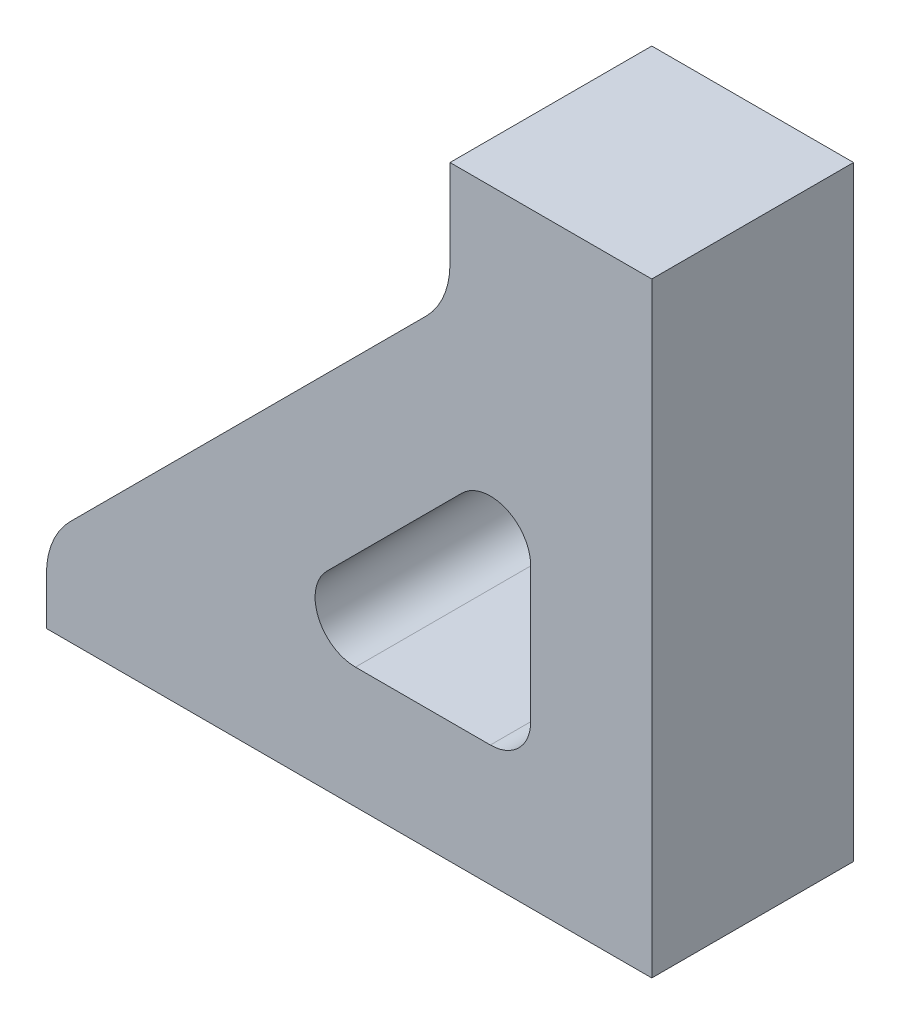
ISO-10303-21;
HEADER;
FILE_DESCRIPTION(('STEP AP214'),'2;1');
FILE_NAME('part.step','',(''),(''),'','','');
FILE_SCHEMA(('AUTOMOTIVE_DESIGN { 1 0 10303 214 1 1 1 1 }'));
ENDSEC;
DATA;
#1=APPLICATION_CONTEXT('core data for automotive mechanical design processes');
#2=APPLICATION_PROTOCOL_DEFINITION('international standard','automotive_design',2000,#1);
#3=PRODUCT_CONTEXT('',#1,'mechanical');
#4=PRODUCT('Part','Part','',(#3));
#5=PRODUCT_RELATED_PRODUCT_CATEGORY('part','',(#4));
#6=PRODUCT_DEFINITION_FORMATION('','',#4);
#7=PRODUCT_DEFINITION_CONTEXT('part definition',#1,'design');
#8=PRODUCT_DEFINITION('design','',#6,#7);
#9=PRODUCT_DEFINITION_SHAPE('','',#8);
#10=(LENGTH_UNIT() NAMED_UNIT(*) SI_UNIT(.MILLI.,.METRE.));
#11=(NAMED_UNIT(*) PLANE_ANGLE_UNIT() SI_UNIT($,.RADIAN.));
#12=(NAMED_UNIT(*) SI_UNIT($,.STERADIAN.) SOLID_ANGLE_UNIT());
#13=UNCERTAINTY_MEASURE_WITH_UNIT(LENGTH_MEASURE(1.E-05),#10,'distance_accuracy_value','');
#14=(GEOMETRIC_REPRESENTATION_CONTEXT(3) GLOBAL_UNCERTAINTY_ASSIGNED_CONTEXT((#13)) GLOBAL_UNIT_ASSIGNED_CONTEXT((#10,
#11,#12)) REPRESENTATION_CONTEXT('',''));
#15=CARTESIAN_POINT('',(0.,0.,0.));
#16=DIRECTION('',(0.,0.,1.));
#17=DIRECTION('',(1.,0.,0.));
#18=AXIS2_PLACEMENT_3D('',#15,#16,#17);
#19=CARTESIAN_POINT('',(0.,0.,-5.));
#20=DIRECTION('',(0.,0.,1.));
#21=DIRECTION('',(1.,0.,0.));
#22=AXIS2_PLACEMENT_3D('',#19,#20,#21);
#23=PLANE('',#22);
#24=DIRECTION('',(1.,0.,0.));
#25=VECTOR('',#24,1.);
#26=CARTESIAN_POINT('',(9.,6.,-5.));
#27=LINE('',#26,#25);
#28=CARTESIAN_POINT('',(7.,6.,-5.));
#29=VERTEX_POINT('',#28);
#30=CARTESIAN_POINT('',(0.3137084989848,6.,-5.));
#31=VERTEX_POINT('',#30);
#32=EDGE_CURVE('E163',#29,#31,#27,.F.);
#33=ORIENTED_EDGE('',*,*,#32,.F.);
#34=CARTESIAN_POINT('',(7.,8.,-5.));
#35=DIRECTION('',(0.,0.,1.));
#36=DIRECTION('',(1.,0.,0.));
#37=AXIS2_PLACEMENT_3D('',#34,#35,#36);
#38=CIRCLE('',#37,2.);
#39=CARTESIAN_POINT('',(9.,8.,-5.));
#40=VERTEX_POINT('',#39);
#41=EDGE_CURVE('E167',#29,#40,#38,.T.);
#42=ORIENTED_EDGE('',*,*,#41,.T.);
#43=DIRECTION('',(0.,1.,0.));
#44=VECTOR('',#43,1.);
#45=CARTESIAN_POINT('',(9.,19.51471862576,-5.));
#46=LINE('',#45,#44);
#47=CARTESIAN_POINT('',(9.,14.68629150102,-5.));
#48=VERTEX_POINT('',#47);
#49=EDGE_CURVE('E154',#48,#40,#46,.F.);
#50=ORIENTED_EDGE('',*,*,#49,.F.);
#51=CARTESIAN_POINT('',(7.,14.68629150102,-5.));
#52=DIRECTION('',(0.,0.,1.));
#53=DIRECTION('',(1.,0.,0.));
#54=AXIS2_PLACEMENT_3D('',#51,#52,#53);
#55=CIRCLE('',#54,2.);
#56=CARTESIAN_POINT('',(5.58578643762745,16.100505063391,-5.));
#57=VERTEX_POINT('',#56);
#58=EDGE_CURVE('E161',#48,#57,#55,.T.);
#59=ORIENTED_EDGE('',*,*,#58,.T.);
#60=DIRECTION('',(0.707106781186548,0.707106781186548,0.));
#61=VECTOR('',#60,1.);
#62=CARTESIAN_POINT('',(-4.514718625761,6.,-5.));
#63=LINE('',#62,#61);
#64=CARTESIAN_POINT('',(-1.10050506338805,9.41421356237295,-5.));
#65=VERTEX_POINT('',#64);
#66=EDGE_CURVE('E158',#65,#57,#63,.T.);
#67=ORIENTED_EDGE('',*,*,#66,.F.);
#68=CARTESIAN_POINT('',(0.3137084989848,8.,-5.));
#69=DIRECTION('',(0.,0.,1.));
#70=DIRECTION('',(1.,0.,0.));
#71=AXIS2_PLACEMENT_3D('',#68,#69,#70);
#72=CIRCLE('',#71,2.);
#73=EDGE_CURVE('E207',#65,#31,#72,.T.);
#74=ORIENTED_EDGE('',*,*,#73,.T.);
#75=EDGE_LOOP('',(#33,#42,#50,#59,#67,#74));
#76=FACE_BOUND('',#75,.T.);
#77=CARTESIAN_POINT('',(1.,25.65685424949,-5.));
#78=DIRECTION('',(0.,0.,1.));
#79=DIRECTION('',(1.,0.,0.));
#80=AXIS2_PLACEMENT_3D('',#77,#78,#79);
#81=CIRCLE('',#80,4.);
#82=CARTESIAN_POINT('',(3.8284271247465,22.8284271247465,-5.));
#83=VERTEX_POINT('',#82);
#84=CARTESIAN_POINT('',(5.,25.65685424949,-5.));
#85=VERTEX_POINT('',#84);
#86=EDGE_CURVE('E20',#83,#85,#81,.T.);
#87=ORIENTED_EDGE('',*,*,#86,.T.);
#88=DIRECTION('',(0.,1.,0.));
#89=VECTOR('',#88,1.);
#90=CARTESIAN_POINT('',(5.,30.,-5.));
#91=LINE('',#90,#89);
#92=CARTESIAN_POINT('',(5.,30.,-5.));
#93=VERTEX_POINT('',#92);
#94=EDGE_CURVE('E173',#93,#85,#91,.F.);
#95=ORIENTED_EDGE('',*,*,#94,.F.);
#96=DIRECTION('',(1.,0.,0.));
#97=VECTOR('',#96,1.);
#98=CARTESIAN_POINT('',(15.,30.,-5.));
#99=LINE('',#98,#97);
#100=CARTESIAN_POINT('',(15.,30.,-5.));
#101=VERTEX_POINT('',#100);
#102=EDGE_CURVE('E106',#101,#93,#99,.F.);
#103=ORIENTED_EDGE('',*,*,#102,.F.);
#104=DIRECTION('',(0.,1.,0.));
#105=VECTOR('',#104,1.);
#106=CARTESIAN_POINT('',(15.,0.,-5.));
#107=LINE('',#106,#105);
#108=CARTESIAN_POINT('',(15.,0.,-5.));
#109=VERTEX_POINT('',#108);
#110=EDGE_CURVE('E138',#109,#101,#107,.T.);
#111=ORIENTED_EDGE('',*,*,#110,.F.);
#112=DIRECTION('',(1.,0.,0.));
#113=VECTOR('',#112,1.);
#114=CARTESIAN_POINT('',(-15.,0.,-5.));
#115=LINE('',#114,#113);
#116=CARTESIAN_POINT('',(-15.,0.,-5.));
#117=VERTEX_POINT('',#116);
#118=EDGE_CURVE('E137',#117,#109,#115,.T.);
#119=ORIENTED_EDGE('',*,*,#118,.F.);
#120=DIRECTION('',(0.,1.,0.));
#121=VECTOR('',#120,1.);
#122=CARTESIAN_POINT('',(-15.,4.,-5.));
#123=LINE('',#122,#121);
#124=CARTESIAN_POINT('',(-15.,2.343145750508,-5.));
#125=VERTEX_POINT('',#124);
#126=EDGE_CURVE('E125',#125,#117,#123,.F.);
#127=ORIENTED_EDGE('',*,*,#126,.F.);
#128=CARTESIAN_POINT('',(-11.,2.343145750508,-5.));
#129=DIRECTION('',(0.,0.,-1.));
#130=DIRECTION('',(-1.,0.,0.));
#131=AXIS2_PLACEMENT_3D('',#128,#129,#130);
#132=CIRCLE('',#131,4.);
#133=CARTESIAN_POINT('',(-13.8284271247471,5.1715728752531,-5.));
#134=VERTEX_POINT('',#133);
#135=EDGE_CURVE('E210',#134,#125,#132,.F.);
#136=ORIENTED_EDGE('',*,*,#135,.F.);
#137=DIRECTION('',(-0.707106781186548,-0.707106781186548,0.));
#138=VECTOR('',#137,1.);
#139=CARTESIAN_POINT('',(5.,24.,-5.));
#140=LINE('',#139,#138);
#141=EDGE_CURVE('E168',#83,#134,#140,.T.);
#142=ORIENTED_EDGE('',*,*,#141,.F.);
#143=EDGE_LOOP('',(#87,#95,#103,#111,#119,#127,#136,#142));
#144=FACE_BOUND('',#143,.T.);
#145=ADVANCED_FACE('F16',(#76,#144),#23,.F.);
#146=CARTESIAN_POINT('',(-15.,4.,-5.));
#147=DIRECTION('',(-1.,0.,0.));
#148=DIRECTION('',(0.,0.,1.));
#149=AXIS2_PLACEMENT_3D('',#146,#147,#148);
#150=PLANE('',#149);
#151=DIRECTION('',(0.,1.,0.));
#152=VECTOR('',#151,1.);
#153=CARTESIAN_POINT('',(-15.,0.,5.));
#154=LINE('',#153,#152);
#155=CARTESIAN_POINT('',(-15.,2.343145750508,5.));
#156=VERTEX_POINT('',#155);
#157=CARTESIAN_POINT('',(-15.,0.,5.));
#158=VERTEX_POINT('',#157);
#159=EDGE_CURVE('E242',#156,#158,#154,.F.);
#160=ORIENTED_EDGE('',*,*,#159,.F.);
#161=DIRECTION('',(0.,0.,-1.));
#162=VECTOR('',#161,1.);
#163=CARTESIAN_POINT('',(-15.,2.343145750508,18.036));
#164=LINE('',#163,#162);
#165=EDGE_CURVE('E132',#125,#156,#164,.F.);
#166=ORIENTED_EDGE('',*,*,#165,.F.);
#167=ORIENTED_EDGE('',*,*,#126,.T.);
#168=DIRECTION('',(0.,0.,-1.));
#169=VECTOR('',#168,1.);
#170=CARTESIAN_POINT('',(-15.,0.,-5.));
#171=LINE('',#170,#169);
#172=EDGE_CURVE('E129',#158,#117,#171,.T.);
#173=ORIENTED_EDGE('',*,*,#172,.F.);
#174=EDGE_LOOP('',(#160,#166,#167,#173));
#175=FACE_BOUND('',#174,.T.);
#176=ADVANCED_FACE('F127',(#175),#150,.T.);
#177=CARTESIAN_POINT('',(-15.,0.,-5.));
#178=DIRECTION('',(0.,-1.,0.));
#179=DIRECTION('',(0.,0.,-1.));
#180=AXIS2_PLACEMENT_3D('',#177,#178,#179);
#181=PLANE('',#180);
#182=ORIENTED_EDGE('',*,*,#172,.T.);
#183=ORIENTED_EDGE('',*,*,#118,.T.);
#184=DIRECTION('',(0.,0.,-1.));
#185=VECTOR('',#184,1.);
#186=CARTESIAN_POINT('',(15.,0.,-5.));
#187=LINE('',#186,#185);
#188=CARTESIAN_POINT('',(15.,0.,5.));
#189=VERTEX_POINT('',#188);
#190=EDGE_CURVE('E141',#189,#109,#187,.T.);
#191=ORIENTED_EDGE('',*,*,#190,.F.);
#192=DIRECTION('',(1.,0.,0.));
#193=VECTOR('',#192,1.);
#194=CARTESIAN_POINT('',(0.,0.,5.));
#195=LINE('',#194,#193);
#196=EDGE_CURVE('E145',#158,#189,#195,.T.);
#197=ORIENTED_EDGE('',*,*,#196,.F.);
#198=EDGE_LOOP('',(#182,#183,#191,#197));
#199=FACE_BOUND('',#198,.T.);
#200=ADVANCED_FACE('F143',(#199),#181,.T.);
#201=CARTESIAN_POINT('',(15.,0.,-5.));
#202=DIRECTION('',(1.,0.,0.));
#203=DIRECTION('',(0.,0.,-1.));
#204=AXIS2_PLACEMENT_3D('',#201,#202,#203);
#205=PLANE('',#204);
#206=ORIENTED_EDGE('',*,*,#190,.T.);
#207=ORIENTED_EDGE('',*,*,#110,.T.);
#208=DIRECTION('',(0.,0.,1.));
#209=VECTOR('',#208,1.);
#210=CARTESIAN_POINT('',(15.,30.,-5.));
#211=LINE('',#210,#209);
#212=CARTESIAN_POINT('',(15.,30.,5.));
#213=VERTEX_POINT('',#212);
#214=EDGE_CURVE('E179',#213,#101,#211,.F.);
#215=ORIENTED_EDGE('',*,*,#214,.F.);
#216=DIRECTION('',(0.,1.,0.));
#217=VECTOR('',#216,1.);
#218=CARTESIAN_POINT('',(15.,0.,5.));
#219=LINE('',#218,#217);
#220=EDGE_CURVE('E230',#189,#213,#219,.T.);
#221=ORIENTED_EDGE('',*,*,#220,.F.);
#222=EDGE_LOOP('',(#206,#207,#215,#221));
#223=FACE_BOUND('',#222,.T.);
#224=ADVANCED_FACE('F289',(#223),#205,.T.);
#225=CARTESIAN_POINT('',(15.,30.,-5.));
#226=DIRECTION('',(0.,1.,0.));
#227=DIRECTION('',(0.,0.,1.));
#228=AXIS2_PLACEMENT_3D('',#225,#226,#227);
#229=PLANE('',#228);
#230=ORIENTED_EDGE('',*,*,#214,.T.);
#231=ORIENTED_EDGE('',*,*,#102,.T.);
#232=DIRECTION('',(0.,0.,1.));
#233=VECTOR('',#232,1.);
#234=CARTESIAN_POINT('',(5.,30.,-5.));
#235=LINE('',#234,#233);
#236=CARTESIAN_POINT('',(5.,30.,5.));
#237=VERTEX_POINT('',#236);
#238=EDGE_CURVE('E175',#237,#93,#235,.F.);
#239=ORIENTED_EDGE('',*,*,#238,.F.);
#240=DIRECTION('',(1.,0.,0.));
#241=VECTOR('',#240,1.);
#242=CARTESIAN_POINT('',(0.,30.,5.));
#243=LINE('',#242,#241);
#244=EDGE_CURVE('E227',#213,#237,#243,.F.);
#245=ORIENTED_EDGE('',*,*,#244,.F.);
#246=EDGE_LOOP('',(#230,#231,#239,#245));
#247=FACE_BOUND('',#246,.T.);
#248=ADVANCED_FACE('F286',(#247),#229,.T.);
#249=CARTESIAN_POINT('',(5.,30.,-5.));
#250=DIRECTION('',(-1.,0.,0.));
#251=DIRECTION('',(0.,0.,1.));
#252=AXIS2_PLACEMENT_3D('',#249,#250,#251);
#253=PLANE('',#252);
#254=ORIENTED_EDGE('',*,*,#94,.T.);
#255=DIRECTION('',(0.,0.,1.));
#256=VECTOR('',#255,1.);
#257=CARTESIAN_POINT('',(5.,25.65685424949,-18.036));
#258=LINE('',#257,#256);
#259=CARTESIAN_POINT('',(5.,25.65685424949,5.));
#260=VERTEX_POINT('',#259);
#261=EDGE_CURVE('E221',#85,#260,#258,.T.);
#262=ORIENTED_EDGE('',*,*,#261,.T.);
#263=DIRECTION('',(0.,1.,0.));
#264=VECTOR('',#263,1.);
#265=CARTESIAN_POINT('',(5.,0.,5.));
#266=LINE('',#265,#264);
#267=EDGE_CURVE('E204',#237,#260,#266,.F.);
#268=ORIENTED_EDGE('',*,*,#267,.F.);
#269=ORIENTED_EDGE('',*,*,#238,.T.);
#270=EDGE_LOOP('',(#254,#262,#268,#269));
#271=FACE_BOUND('',#270,.T.);
#272=ADVANCED_FACE('F285',(#271),#253,.T.);
#273=CARTESIAN_POINT('',(1.,25.65685424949,-18.036));
#274=DIRECTION('',(0.,0.,1.));
#275=DIRECTION('',(1.,0.,0.));
#276=AXIS2_PLACEMENT_3D('',#273,#274,#275);
#277=CYLINDRICAL_SURFACE('',#276,4.);
#278=ORIENTED_EDGE('',*,*,#261,.F.);
#279=ORIENTED_EDGE('',*,*,#86,.F.);
#280=DIRECTION('',(0.,0.,1.));
#281=VECTOR('',#280,1.);
#282=CARTESIAN_POINT('',(3.828427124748,22.828427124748,-5.));
#283=LINE('',#282,#281);
#284=CARTESIAN_POINT('',(3.8284271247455,22.8284271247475,5.));
#285=VERTEX_POINT('',#284);
#286=EDGE_CURVE('E169',#285,#83,#283,.F.);
#287=ORIENTED_EDGE('',*,*,#286,.F.);
#288=CARTESIAN_POINT('',(1.,25.65685424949,5.));
#289=DIRECTION('',(0.,0.,1.));
#290=DIRECTION('',(1.,0.,0.));
#291=AXIS2_PLACEMENT_3D('',#288,#289,#290);
#292=CIRCLE('',#291,4.);
#293=EDGE_CURVE('E201',#260,#285,#292,.F.);
#294=ORIENTED_EDGE('',*,*,#293,.F.);
#295=EDGE_LOOP('',(#278,#279,#287,#294));
#296=FACE_BOUND('',#295,.T.);
#297=ADVANCED_FACE('F290',(#296),#277,.F.);
#298=CARTESIAN_POINT('',(5.,24.,-5.));
#299=DIRECTION('',(-0.707106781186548,0.707106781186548,0.));
#300=DIRECTION('',(-0.707106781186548,-0.707106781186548,0.));
#301=AXIS2_PLACEMENT_3D('',#298,#299,#300);
#302=PLANE('',#301);
#303=ORIENTED_EDGE('',*,*,#141,.T.);
#304=DIRECTION('',(0.,0.,-1.));
#305=VECTOR('',#304,1.);
#306=CARTESIAN_POINT('',(-13.8284271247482,5.17157287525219,18.036));
#307=LINE('',#306,#305);
#308=CARTESIAN_POINT('',(-13.8284271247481,5.1715728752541,5.));
#309=VERTEX_POINT('',#308);
#310=EDGE_CURVE('E211',#309,#134,#307,.T.);
#311=ORIENTED_EDGE('',*,*,#310,.F.);
#312=DIRECTION('',(-0.707106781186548,-0.707106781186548,0.));
#313=VECTOR('',#312,1.);
#314=CARTESIAN_POINT('',(3.828427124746,22.82842712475,5.));
#315=LINE('',#314,#313);
#316=EDGE_CURVE('E200',#285,#309,#315,.T.);
#317=ORIENTED_EDGE('',*,*,#316,.F.);
#318=ORIENTED_EDGE('',*,*,#286,.T.);
#319=EDGE_LOOP('',(#303,#311,#317,#318));
#320=FACE_BOUND('',#319,.T.);
#321=ADVANCED_FACE('F293',(#320),#302,.T.);
#322=CARTESIAN_POINT('',(-11.,2.343145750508,18.036));
#323=DIRECTION('',(0.,0.,-1.));
#324=DIRECTION('',(-1.,0.,0.));
#325=AXIS2_PLACEMENT_3D('',#322,#323,#324);
#326=CYLINDRICAL_SURFACE('',#325,4.);
#327=ORIENTED_EDGE('',*,*,#310,.T.);
#328=ORIENTED_EDGE('',*,*,#135,.T.);
#329=ORIENTED_EDGE('',*,*,#165,.T.);
#330=CARTESIAN_POINT('',(-11.,2.343145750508,5.));
#331=DIRECTION('',(0.,0.,-1.));
#332=DIRECTION('',(-1.,0.,0.));
#333=AXIS2_PLACEMENT_3D('',#330,#331,#332);
#334=CIRCLE('',#333,4.);
#335=EDGE_CURVE('E197',#309,#156,#334,.F.);
#336=ORIENTED_EDGE('',*,*,#335,.F.);
#337=EDGE_LOOP('',(#327,#328,#329,#336));
#338=FACE_BOUND('',#337,.T.);
#339=ADVANCED_FACE('F294',(#338),#326,.T.);
#340=CARTESIAN_POINT('',(7.,8.,-18.036));
#341=DIRECTION('',(0.,0.,1.));
#342=DIRECTION('',(1.,0.,0.));
#343=AXIS2_PLACEMENT_3D('',#340,#341,#342);
#344=CYLINDRICAL_SURFACE('',#343,2.);
#345=DIRECTION('',(0.,0.,1.));
#346=VECTOR('',#345,1.);
#347=CARTESIAN_POINT('',(9.,8.,-5.));
#348=LINE('',#347,#346);
#349=CARTESIAN_POINT('',(9.,8.,5.));
#350=VERTEX_POINT('',#349);
#351=EDGE_CURVE('E157',#40,#350,#348,.T.);
#352=ORIENTED_EDGE('',*,*,#351,.F.);
#353=ORIENTED_EDGE('',*,*,#41,.F.);
#354=DIRECTION('',(0.,0.,1.));
#355=VECTOR('',#354,1.);
#356=CARTESIAN_POINT('',(7.,6.,-5.));
#357=LINE('',#356,#355);
#358=CARTESIAN_POINT('',(7.,6.,5.));
#359=VERTEX_POINT('',#358);
#360=EDGE_CURVE('E166',#359,#29,#357,.F.);
#361=ORIENTED_EDGE('',*,*,#360,.F.);
#362=CARTESIAN_POINT('',(7.,8.,5.));
#363=DIRECTION('',(0.,0.,1.));
#364=DIRECTION('',(1.,0.,0.));
#365=AXIS2_PLACEMENT_3D('',#362,#363,#364);
#366=CIRCLE('',#365,2.);
#367=EDGE_CURVE('E194',#350,#359,#366,.F.);
#368=ORIENTED_EDGE('',*,*,#367,.F.);
#369=EDGE_LOOP('',(#352,#353,#361,#368));
#370=FACE_BOUND('',#369,.T.);
#371=ADVANCED_FACE('F266',(#370),#344,.F.);
#372=CARTESIAN_POINT('',(9.,6.,-5.));
#373=DIRECTION('',(0.,1.,0.));
#374=DIRECTION('',(0.,0.,1.));
#375=AXIS2_PLACEMENT_3D('',#372,#373,#374);
#376=PLANE('',#375);
#377=DIRECTION('',(1.,0.,0.));
#378=VECTOR('',#377,1.);
#379=CARTESIAN_POINT('',(0.,6.,5.));
#380=LINE('',#379,#378);
#381=CARTESIAN_POINT('',(0.3137084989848,6.,5.));
#382=VERTEX_POINT('',#381);
#383=EDGE_CURVE('E193',#359,#382,#380,.F.);
#384=ORIENTED_EDGE('',*,*,#383,.F.);
#385=ORIENTED_EDGE('',*,*,#360,.T.);
#386=ORIENTED_EDGE('',*,*,#32,.T.);
#387=DIRECTION('',(0.,0.,1.));
#388=VECTOR('',#387,1.);
#389=CARTESIAN_POINT('',(0.3137084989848,6.,-18.036));
#390=LINE('',#389,#388);
#391=EDGE_CURVE('E209',#31,#382,#390,.T.);
#392=ORIENTED_EDGE('',*,*,#391,.T.);
#393=EDGE_LOOP('',(#384,#385,#386,#392));
#394=FACE_BOUND('',#393,.T.);
#395=ADVANCED_FACE('F260',(#394),#376,.T.);
#396=CARTESIAN_POINT('',(0.3137084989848,8.,-18.036));
#397=DIRECTION('',(0.,0.,1.));
#398=DIRECTION('',(1.,0.,0.));
#399=AXIS2_PLACEMENT_3D('',#396,#397,#398);
#400=CYLINDRICAL_SURFACE('',#399,2.);
#401=ORIENTED_EDGE('',*,*,#391,.F.);
#402=ORIENTED_EDGE('',*,*,#73,.F.);
#403=DIRECTION('',(0.,0.,1.));
#404=VECTOR('',#403,1.);
#405=CARTESIAN_POINT('',(-1.100505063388,9.414213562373,-5.));
#406=LINE('',#405,#404);
#407=CARTESIAN_POINT('',(-1.10050506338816,9.41421356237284,5.));
#408=VERTEX_POINT('',#407);
#409=EDGE_CURVE('E162',#408,#65,#406,.F.);
#410=ORIENTED_EDGE('',*,*,#409,.F.);
#411=CARTESIAN_POINT('',(0.3137084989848,8.,5.));
#412=DIRECTION('',(0.,0.,1.));
#413=DIRECTION('',(1.,0.,0.));
#414=AXIS2_PLACEMENT_3D('',#411,#412,#413);
#415=CIRCLE('',#414,2.);
#416=EDGE_CURVE('E190',#382,#408,#415,.F.);
#417=ORIENTED_EDGE('',*,*,#416,.F.);
#418=EDGE_LOOP('',(#401,#402,#410,#417));
#419=FACE_BOUND('',#418,.T.);
#420=ADVANCED_FACE('F271',(#419),#400,.F.);
#421=CARTESIAN_POINT('',(-4.514718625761,6.,-5.));
#422=DIRECTION('',(0.707106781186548,-0.707106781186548,0.));
#423=DIRECTION('',(0.707106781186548,0.707106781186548,0.));
#424=AXIS2_PLACEMENT_3D('',#421,#422,#423);
#425=PLANE('',#424);
#426=ORIENTED_EDGE('',*,*,#66,.T.);
#427=DIRECTION('',(0.,0.,1.));
#428=VECTOR('',#427,1.);
#429=CARTESIAN_POINT('',(5.5857864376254,16.1005050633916,-18.036));
#430=LINE('',#429,#428);
#431=CARTESIAN_POINT('',(5.58578643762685,16.1005050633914,5.));
#432=VERTEX_POINT('',#431);
#433=EDGE_CURVE('E206',#57,#432,#430,.T.);
#434=ORIENTED_EDGE('',*,*,#433,.T.);
#435=DIRECTION('',(0.707106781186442,0.707106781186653,0.));
#436=VECTOR('',#435,1.);
#437=CARTESIAN_POINT('',(-1.100505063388,9.414213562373,5.));
#438=LINE('',#437,#436);
#439=EDGE_CURVE('E189',#408,#432,#438,.T.);
#440=ORIENTED_EDGE('',*,*,#439,.F.);
#441=ORIENTED_EDGE('',*,*,#409,.T.);
#442=EDGE_LOOP('',(#426,#434,#440,#441));
#443=FACE_BOUND('',#442,.T.);
#444=ADVANCED_FACE('F314',(#443),#425,.T.);
#445=CARTESIAN_POINT('',(7.,14.68629150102,-18.036));
#446=DIRECTION('',(0.,0.,1.));
#447=DIRECTION('',(1.,0.,0.));
#448=AXIS2_PLACEMENT_3D('',#445,#446,#447);
#449=CYLINDRICAL_SURFACE('',#448,2.);
#450=ORIENTED_EDGE('',*,*,#433,.F.);
#451=ORIENTED_EDGE('',*,*,#58,.F.);
#452=DIRECTION('',(0.,0.,1.));
#453=VECTOR('',#452,1.);
#454=CARTESIAN_POINT('',(9.,14.68629150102,-5.));
#455=LINE('',#454,#453);
#456=CARTESIAN_POINT('',(9.,14.68629150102,5.));
#457=VERTEX_POINT('',#456);
#458=EDGE_CURVE('E35',#457,#48,#455,.F.);
#459=ORIENTED_EDGE('',*,*,#458,.F.);
#460=CARTESIAN_POINT('',(7.,14.68629150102,5.));
#461=DIRECTION('',(0.,0.,1.));
#462=DIRECTION('',(1.,0.,0.));
#463=AXIS2_PLACEMENT_3D('',#460,#461,#462);
#464=CIRCLE('',#463,2.);
#465=EDGE_CURVE('E26',#432,#457,#464,.F.);
#466=ORIENTED_EDGE('',*,*,#465,.F.);
#467=EDGE_LOOP('',(#450,#451,#459,#466));
#468=FACE_BOUND('',#467,.T.);
#469=ADVANCED_FACE('F309',(#468),#449,.F.);
#470=CARTESIAN_POINT('',(9.,19.51471862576,-5.));
#471=DIRECTION('',(-1.,0.,0.));
#472=DIRECTION('',(0.,0.,1.));
#473=AXIS2_PLACEMENT_3D('',#470,#471,#472);
#474=PLANE('',#473);
#475=ORIENTED_EDGE('',*,*,#49,.T.);
#476=ORIENTED_EDGE('',*,*,#351,.T.);
#477=DIRECTION('',(0.,1.,0.));
#478=VECTOR('',#477,1.);
#479=CARTESIAN_POINT('',(9.,0.,5.));
#480=LINE('',#479,#478);
#481=EDGE_CURVE('E11',#457,#350,#480,.F.);
#482=ORIENTED_EDGE('',*,*,#481,.F.);
#483=ORIENTED_EDGE('',*,*,#458,.T.);
#484=EDGE_LOOP('',(#475,#476,#482,#483));
#485=FACE_BOUND('',#484,.T.);
#486=ADVANCED_FACE('F305',(#485),#474,.T.);
#487=CARTESIAN_POINT('',(0.,0.,5.));
#488=DIRECTION('',(0.,0.,1.));
#489=DIRECTION('',(1.,0.,0.));
#490=AXIS2_PLACEMENT_3D('',#487,#488,#489);
#491=PLANE('',#490);
#492=ORIENTED_EDGE('',*,*,#465,.T.);
#493=ORIENTED_EDGE('',*,*,#481,.T.);
#494=ORIENTED_EDGE('',*,*,#367,.T.);
#495=ORIENTED_EDGE('',*,*,#383,.T.);
#496=ORIENTED_EDGE('',*,*,#416,.T.);
#497=ORIENTED_EDGE('',*,*,#439,.T.);
#498=EDGE_LOOP('',(#492,#493,#494,#495,#496,#497));
#499=FACE_BOUND('',#498,.T.);
#500=ORIENTED_EDGE('',*,*,#316,.T.);
#501=ORIENTED_EDGE('',*,*,#335,.T.);
#502=ORIENTED_EDGE('',*,*,#159,.T.);
#503=ORIENTED_EDGE('',*,*,#196,.T.);
#504=ORIENTED_EDGE('',*,*,#220,.T.);
#505=ORIENTED_EDGE('',*,*,#244,.T.);
#506=ORIENTED_EDGE('',*,*,#267,.T.);
#507=ORIENTED_EDGE('',*,*,#293,.T.);
#508=EDGE_LOOP('',(#500,#501,#502,#503,#504,#505,#506,#507));
#509=FACE_BOUND('',#508,.T.);
#510=ADVANCED_FACE('F18',(#499,#509),#491,.T.);
#511=CLOSED_SHELL('',(#145,#176,#200,#224,#248,#272,#297,#321,#339,#371,#395,#420,#444,#469,
#486,#510));
#512=MANIFOLD_SOLID_BREP('B1',#511);
#513=ADVANCED_BREP_SHAPE_REPRESENTATION('',(#18,#512),#14);
#514=SHAPE_DEFINITION_REPRESENTATION(#9,#513);
ENDSEC;
END-ISO-10303-21;
